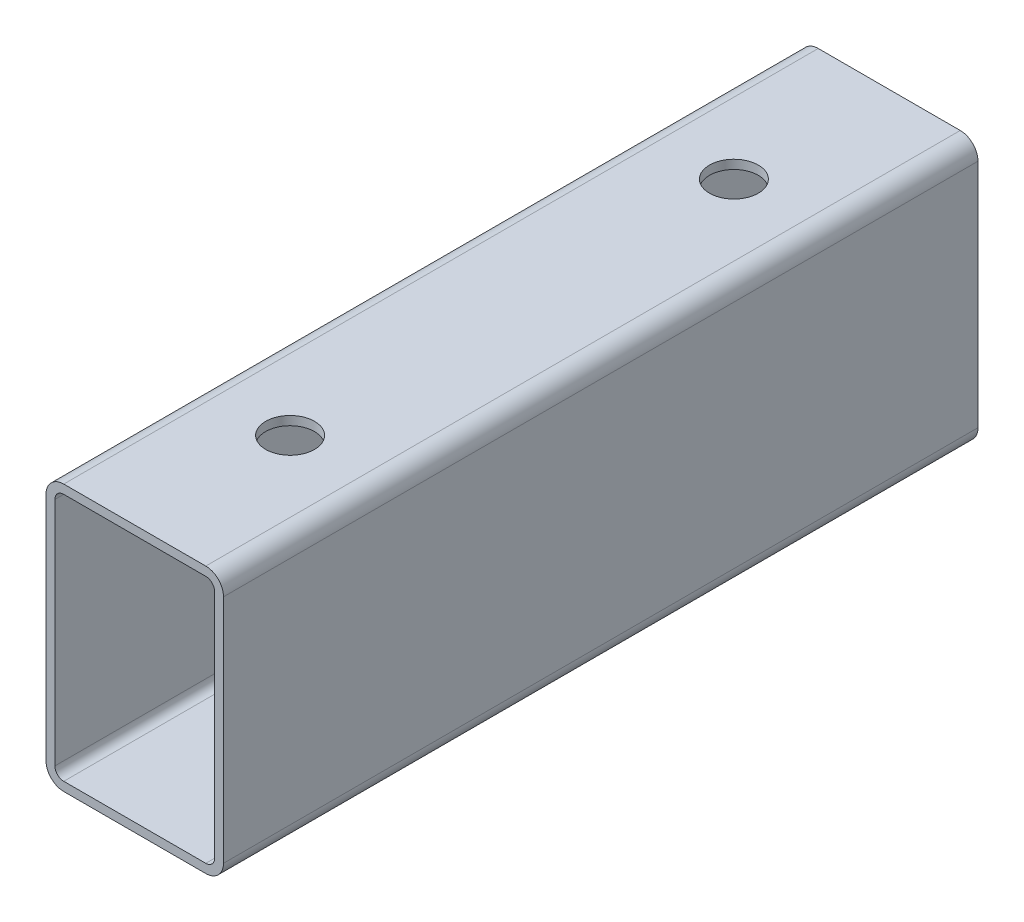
from build123d import *

# Parameters (mm, degrees)
BASE_EXTRU_MINCE_DEPTH     = 85
ESQUISSE3_W                = 5.5
ESQUISSE3_H                = 60
R_P_TITION_LIN_AIRE1_COUNT = 2
R_P_TITION_LIN_AIRE1_PITCH = 100


with BuildPart() as part:
    # Esquisse2 → Base-Extru.-Mince (new, symmetric)
    with BuildSketch(Plane.XY):
        with BuildLine():
            Line((16, 30), (-16, 30))
            ThreePointArc((-16, 30), (-18.828427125, 28.828427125), (-20, 26))
            Line((-20, 26), (-20, -26))
            ThreePointArc((-20, -26), (-18.828427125, -28.828427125), (-16, -30))
            Line((-16, -30), (16, -30))
            ThreePointArc((16, -30), (18.828427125, -28.828427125), (20, -26))
            Line((20, -26), (20, 26))
            ThreePointArc((20, 26), (18.828427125, 28.828427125), (16, 30))
        make_face()
        with BuildLine():
            Line((16, 28), (-16, 28))
            ThreePointArc((-16, 28), (-17.414213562, 27.414213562), (-18, 26))
            Line((-18, 26), (-18, -26))
            ThreePointArc((-18, -26), (-17.414213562, -27.414213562), (-16, -28))
            Line((-16, -28), (16, -28))
            ThreePointArc((16, -28), (17.414213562, -27.414213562), (18, -26))
            Line((18, -26), (18, 26))
            ThreePointArc((18, 26), (17.414213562, 27.414213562), (16, 28))
        make_face(mode=Mode.SUBTRACT)
    extrude(amount=BASE_EXTRU_MINCE_DEPTH, both=True)

    # Esquisse3 → Enl_vement de mati_re-R_volution1 (revolve, cut)
    with BuildSketch(Plane(origin=(0, 0, 0), x_dir=(0, 0, -1), z_dir=(1, 0, 0)), mode=Mode.PRIVATE) as enl_vement_de_mati_re_r_volution1_sk:
        with Locations((52.75, 0)):
            Rectangle(ESQUISSE3_W, ESQUISSE3_H)
    enl_vement_de_mati_re_r_volution1 = revolve(enl_vement_de_mati_re_r_volution1_sk.sketch.rotate(Axis((0, 37.644287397, -50), (0, -1, 0)), 180), axis=Axis((0, 37.644287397, -50), (0, -1, 0)), mode=Mode.SUBTRACT)

    # R_p_tition lin_aire1: Enl_vement de mati_re-R_volution1 ×2
    with Locations(*[(0, 0, i * R_P_TITION_LIN_AIRE1_PITCH) for i in range(1, R_P_TITION_LIN_AIRE1_COUNT)]):
        add(enl_vement_de_mati_re_r_volution1, mode=Mode.SUBTRACT)


solid = part.part
